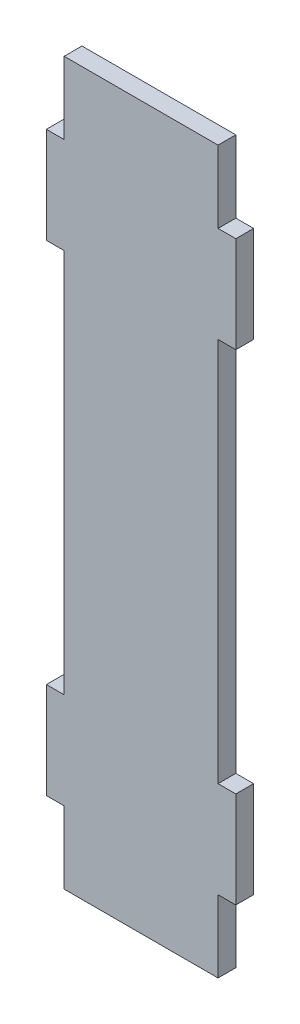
from build123d import *

# Parameters (mm, degrees)
BOSS_EXTRUDE2_DEPTH = 3.7


with BuildPart() as part:
    # Sketch1 → Boss-Extrude2 (new body)
    with BuildSketch(Plane.XY):
        Polygon((16, 135), (19.7, 135), (19.7, 115), (16, 115), (16, 35), (19.7, 35), (19.7, 15), (16, 15), (16, 0), (-16, 0), (-16, 15), (-19.7, 15), (-19.7, 35), (-16, 35), (-16, 115), (-19.7, 115), (-19.7, 135), (-16, 135), (-16, 150), (16, 150), align=None)
    extrude(amount=BOSS_EXTRUDE2_DEPTH)


solid = part.part
